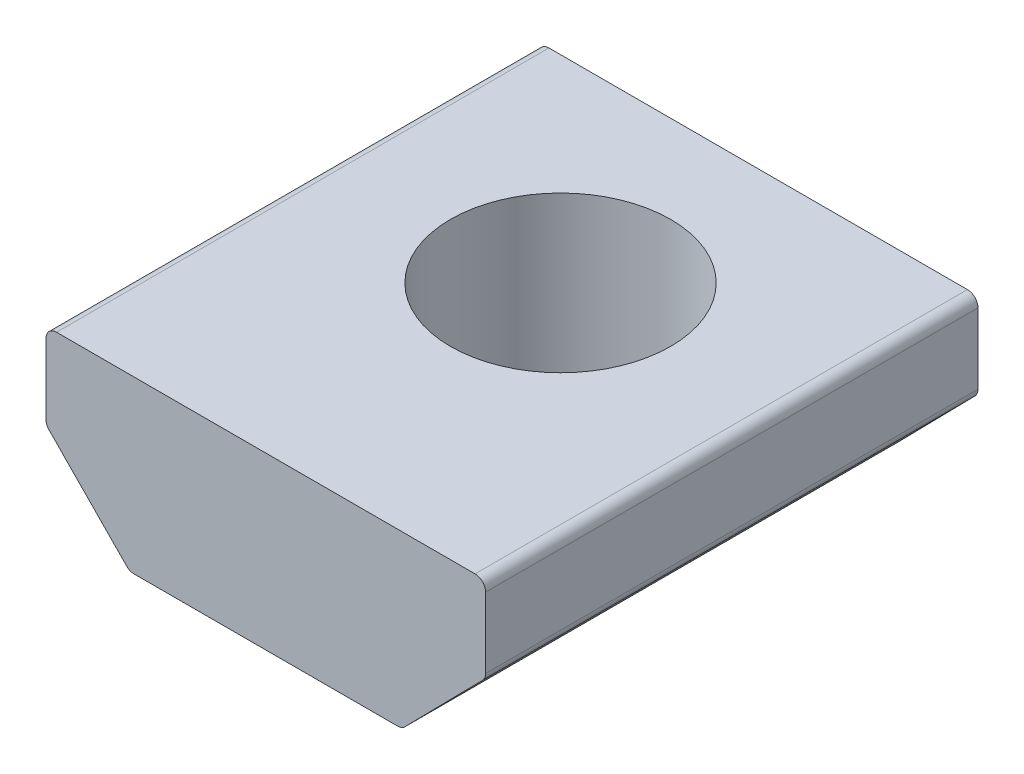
from build123d import *

# Parameters (mm, degrees)
EXTRUDE1_DEPTH     = 17.78
SKETCH2_R          = 3.9751
CUT_EXTRUDE1_DEPTH = 21.422334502


with BuildPart() as part:
    # Sketch1 → Extrude1 (new body)
    with BuildSketch(Plane.XY):
        with BuildLine():
            Line((-7.5565, 0), (7.5565, 0))
            ThreePointArc((7.5565, 0), (7.825907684, -0.111592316), (7.9375, -0.381))
            Line((7.9375, -0.381), (7.9375, -2.924020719))
            ThreePointArc((7.9375, -2.924020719), (7.909176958, -3.068173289), (7.828418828, -3.190893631))
            Line((7.828418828, -3.190893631), (5.026909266, -6.045372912))
            ThreePointArc((5.026909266, -6.045372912), (4.902439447, -6.129811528), (4.754990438, -6.1595))
            Line((4.754990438, -6.1595), (-4.754990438, -6.1595))
            ThreePointArc((-4.754990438, -6.1595), (-4.902439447, -6.129811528), (-5.026909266, -6.045372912))
            Line((-5.026909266, -6.045372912), (-7.828418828, -3.190893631))
            ThreePointArc((-7.828418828, -3.190893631), (-7.909176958, -3.068173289), (-7.9375, -2.924020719))
            Line((-7.9375, -2.924020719), (-7.9375, -0.381))
            ThreePointArc((-7.9375, -0.381), (-7.825907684, -0.111592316), (-7.5565, 0))
        make_face()
    extrude(amount=EXTRUDE1_DEPTH)

    # Sketch2 → Cut-Extrude1 (cut, through all)
    with BuildSketch(Plane(origin=(0, 0, 0), x_dir=(-1, 0, 0), z_dir=(0, 1, 0))):
        with Locations((0, 7.1374)):
            Circle(SKETCH2_R)
    extrude(amount=-CUT_EXTRUDE1_DEPTH, mode=Mode.SUBTRACT)


solid = part.part
